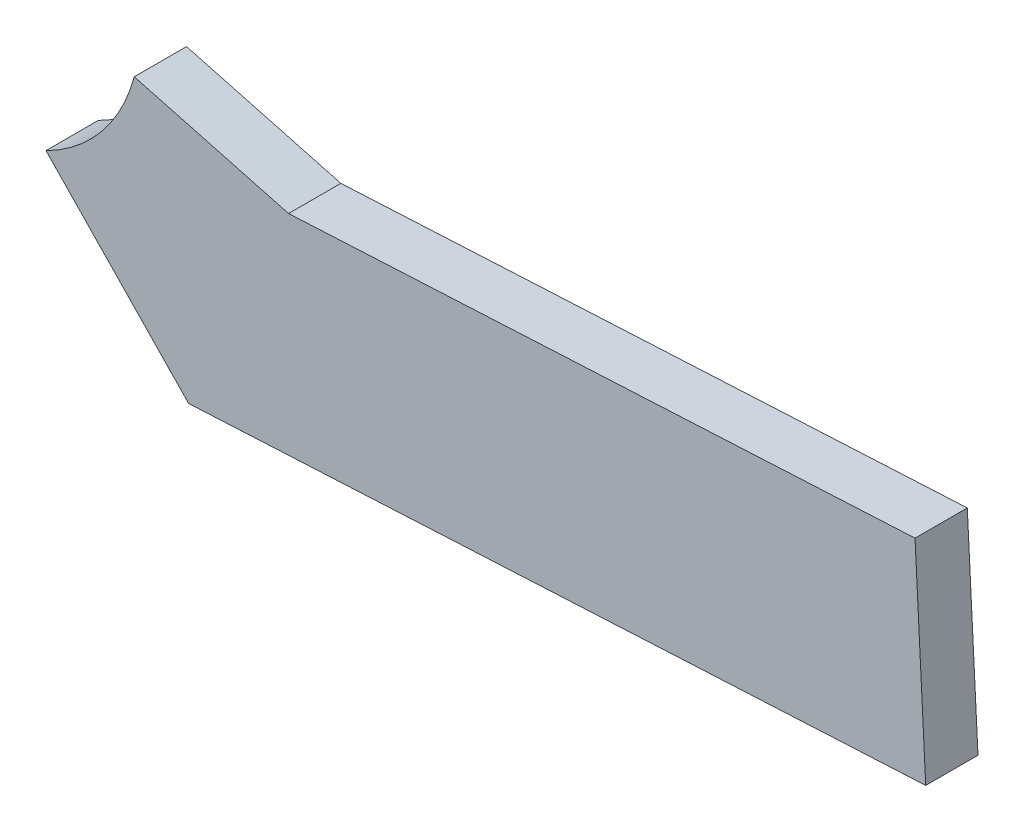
ISO-10303-21;
HEADER;
FILE_DESCRIPTION(('STEP AP214'),'2;1');
FILE_NAME('part.step','',(''),(''),'','','');
FILE_SCHEMA(('AUTOMOTIVE_DESIGN { 1 0 10303 214 1 1 1 1 }'));
ENDSEC;
DATA;
#1=APPLICATION_CONTEXT('core data for automotive mechanical design processes');
#2=APPLICATION_PROTOCOL_DEFINITION('international standard','automotive_design',2000,#1);
#3=PRODUCT_CONTEXT('',#1,'mechanical');
#4=PRODUCT('Part','Part','',(#3));
#5=PRODUCT_RELATED_PRODUCT_CATEGORY('part','',(#4));
#6=PRODUCT_DEFINITION_FORMATION('','',#4);
#7=PRODUCT_DEFINITION_CONTEXT('part definition',#1,'design');
#8=PRODUCT_DEFINITION('design','',#6,#7);
#9=PRODUCT_DEFINITION_SHAPE('','',#8);
#10=(LENGTH_UNIT() NAMED_UNIT(*) SI_UNIT(.MILLI.,.METRE.));
#11=(NAMED_UNIT(*) PLANE_ANGLE_UNIT() SI_UNIT($,.RADIAN.));
#12=(NAMED_UNIT(*) SI_UNIT($,.STERADIAN.) SOLID_ANGLE_UNIT());
#13=UNCERTAINTY_MEASURE_WITH_UNIT(LENGTH_MEASURE(1.E-05),#10,'distance_accuracy_value','');
#14=(GEOMETRIC_REPRESENTATION_CONTEXT(3) GLOBAL_UNCERTAINTY_ASSIGNED_CONTEXT((#13)) GLOBAL_UNIT_ASSIGNED_CONTEXT((#10,
#11,#12)) REPRESENTATION_CONTEXT('',''));
#15=CARTESIAN_POINT('',(0.,0.,0.));
#16=DIRECTION('',(0.,0.,1.));
#17=DIRECTION('',(1.,0.,0.));
#18=AXIS2_PLACEMENT_3D('',#15,#16,#17);
#19=CARTESIAN_POINT('',(246.482371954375,13.1523666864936,0.));
#20=DIRECTION('',(0.,0.,1.));
#21=DIRECTION('',(0.,-1.,0.));
#22=AXIS2_PLACEMENT_3D('',#19,#20,#21);
#23=CYLINDRICAL_SURFACE('',#22,20.6375);
#24=DIRECTION('',(0.,0.,1.));
#25=VECTOR('',#24,1.);
#26=CARTESIAN_POINT('',(255.695398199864,-5.31453759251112,0.));
#27=LINE('',#26,#25);
#28=CARTESIAN_POINT('',(255.695398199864,-5.31453759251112,0.));
#29=VERTEX_POINT('',#28);
#30=CARTESIAN_POINT('',(255.695398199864,-5.31453759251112,6.35));
#31=VERTEX_POINT('',#30);
#32=EDGE_CURVE('E35',#29,#31,#27,.T.);
#33=ORIENTED_EDGE('',*,*,#32,.T.);
#34=CARTESIAN_POINT('',(246.482371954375,13.1523666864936,6.35));
#35=DIRECTION('',(0.,0.,-1.));
#36=DIRECTION('',(0.,-1.,0.));
#37=AXIS2_PLACEMENT_3D('',#34,#35,#36);
#38=CIRCLE('',#37,20.6375);
#39=CARTESIAN_POINT('',(266.418071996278,7.81623793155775,6.35));
#40=VERTEX_POINT('',#39);
#41=EDGE_CURVE('E84',#40,#31,#38,.T.);
#42=ORIENTED_EDGE('',*,*,#41,.F.);
#43=DIRECTION('',(0.,0.,1.));
#44=VECTOR('',#43,1.);
#45=CARTESIAN_POINT('',(266.418071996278,7.81623793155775,0.));
#46=LINE('',#45,#44);
#47=CARTESIAN_POINT('',(266.418071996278,7.81623793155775,0.));
#48=VERTEX_POINT('',#47);
#49=EDGE_CURVE('E11',#48,#40,#46,.T.);
#50=ORIENTED_EDGE('',*,*,#49,.F.);
#51=CARTESIAN_POINT('',(246.482371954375,13.1523666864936,0.));
#52=DIRECTION('',(0.,0.,-1.));
#53=DIRECTION('',(0.,-1.,0.));
#54=AXIS2_PLACEMENT_3D('',#51,#52,#53);
#55=CIRCLE('',#54,20.6375);
#56=EDGE_CURVE('E85',#48,#29,#55,.T.);
#57=ORIENTED_EDGE('',*,*,#56,.T.);
#58=EDGE_LOOP('',(#33,#42,#50,#57));
#59=FACE_BOUND('',#58,.T.);
#60=ADVANCED_FACE('F32',(#59),#23,.F.);
#61=CARTESIAN_POINT('',(266.418071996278,7.81623793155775,0.));
#62=DIRECTION('',(0.258564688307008,0.965993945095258,0.));
#63=DIRECTION('',(-0.965993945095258,0.258564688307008,0.));
#64=AXIS2_PLACEMENT_3D('',#61,#62,#63);
#65=PLANE('',#64);
#66=ORIENTED_EDGE('',*,*,#49,.T.);
#67=DIRECTION('',(-0.965993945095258,0.258564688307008,0.));
#68=VECTOR('',#67,1.);
#69=CARTESIAN_POINT('',(266.418071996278,7.81623793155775,6.35));
#70=LINE('',#69,#68);
#71=CARTESIAN_POINT('',(285.163311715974,2.79875610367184,6.35));
#72=VERTEX_POINT('',#71);
#73=EDGE_CURVE('E102',#72,#40,#70,.T.);
#74=ORIENTED_EDGE('',*,*,#73,.F.);
#75=DIRECTION('',(0.,0.,1.));
#76=VECTOR('',#75,1.);
#77=CARTESIAN_POINT('',(285.163311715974,2.79875610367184,0.));
#78=LINE('',#77,#76);
#79=CARTESIAN_POINT('',(285.163311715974,2.79875610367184,0.));
#80=VERTEX_POINT('',#79);
#81=EDGE_CURVE('E40',#80,#72,#78,.T.);
#82=ORIENTED_EDGE('',*,*,#81,.F.);
#83=DIRECTION('',(-0.965993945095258,0.258564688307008,0.));
#84=VECTOR('',#83,1.);
#85=CARTESIAN_POINT('',(266.418071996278,7.81623793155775,0.));
#86=LINE('',#85,#84);
#87=EDGE_CURVE('E90',#80,#48,#86,.T.);
#88=ORIENTED_EDGE('',*,*,#87,.T.);
#89=EDGE_LOOP('',(#66,#74,#82,#88));
#90=FACE_BOUND('',#89,.T.);
#91=ADVANCED_FACE('F142',(#90),#65,.T.);
#92=CARTESIAN_POINT('',(285.163311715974,2.79875610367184,0.));
#93=DIRECTION('',(-0.0512082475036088,0.998687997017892,0.));
#94=DIRECTION('',(-0.998687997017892,-0.0512082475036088,0.));
#95=AXIS2_PLACEMENT_3D('',#92,#93,#94);
#96=PLANE('',#95);
#97=ORIENTED_EDGE('',*,*,#81,.T.);
#98=DIRECTION('',(-0.998687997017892,-0.0512082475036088,0.));
#99=VECTOR('',#98,1.);
#100=CARTESIAN_POINT('',(285.163311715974,2.79875610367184,6.35));
#101=LINE('',#100,#99);
#102=CARTESIAN_POINT('',(361.263337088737,6.70082456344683,6.35));
#103=VERTEX_POINT('',#102);
#104=EDGE_CURVE('E109',#103,#72,#101,.T.);
#105=ORIENTED_EDGE('',*,*,#104,.F.);
#106=DIRECTION('',(0.,0.,1.));
#107=VECTOR('',#106,1.);
#108=CARTESIAN_POINT('',(361.263337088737,6.70082456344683,0.));
#109=LINE('',#108,#107);
#110=CARTESIAN_POINT('',(361.263337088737,6.70082456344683,0.));
#111=VERTEX_POINT('',#110);
#112=EDGE_CURVE('E125',#111,#103,#109,.T.);
#113=ORIENTED_EDGE('',*,*,#112,.F.);
#114=DIRECTION('',(-0.998687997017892,-0.0512082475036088,0.));
#115=VECTOR('',#114,1.);
#116=CARTESIAN_POINT('',(285.163311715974,2.79875610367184,0.));
#117=LINE('',#116,#115);
#118=EDGE_CURVE('E121',#111,#80,#117,.T.);
#119=ORIENTED_EDGE('',*,*,#118,.T.);
#120=EDGE_LOOP('',(#97,#105,#113,#119));
#121=FACE_BOUND('',#120,.T.);
#122=ADVANCED_FACE('F138',(#121),#96,.T.);
#123=CARTESIAN_POINT('',(361.263337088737,6.70082456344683,0.));
#124=DIRECTION('',(0.998687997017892,0.0512082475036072,0.));
#125=DIRECTION('',(-0.0512082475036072,0.998687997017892,0.));
#126=AXIS2_PLACEMENT_3D('',#123,#124,#125);
#127=PLANE('',#126);
#128=ORIENTED_EDGE('',*,*,#112,.T.);
#129=DIRECTION('',(-0.0512082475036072,0.998687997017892,0.));
#130=VECTOR('',#129,1.);
#131=CARTESIAN_POINT('',(361.263337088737,6.70082456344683,6.35));
#132=LINE('',#131,#130);
#133=CARTESIAN_POINT('',(362.564026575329,-18.6658505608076,6.35));
#134=VERTEX_POINT('',#133);
#135=EDGE_CURVE('E106',#134,#103,#132,.T.);
#136=ORIENTED_EDGE('',*,*,#135,.F.);
#137=DIRECTION('',(0.,0.,1.));
#138=VECTOR('',#137,1.);
#139=CARTESIAN_POINT('',(362.564026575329,-18.6658505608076,0.));
#140=LINE('',#139,#138);
#141=CARTESIAN_POINT('',(362.564026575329,-18.6658505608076,0.));
#142=VERTEX_POINT('',#141);
#143=EDGE_CURVE('E127',#142,#134,#140,.T.);
#144=ORIENTED_EDGE('',*,*,#143,.F.);
#145=DIRECTION('',(-0.0512082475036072,0.998687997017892,0.));
#146=VECTOR('',#145,1.);
#147=CARTESIAN_POINT('',(361.263337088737,6.70082456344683,0.));
#148=LINE('',#147,#146);
#149=EDGE_CURVE('E118',#142,#111,#148,.T.);
#150=ORIENTED_EDGE('',*,*,#149,.T.);
#151=EDGE_LOOP('',(#128,#136,#144,#150));
#152=FACE_BOUND('',#151,.T.);
#153=ADVANCED_FACE('F135',(#152),#127,.T.);
#154=CARTESIAN_POINT('',(362.564026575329,-18.6658505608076,0.));
#155=DIRECTION('',(0.0512082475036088,-0.998687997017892,0.));
#156=DIRECTION('',(0.998687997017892,0.0512082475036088,0.));
#157=AXIS2_PLACEMENT_3D('',#154,#155,#156);
#158=PLANE('',#157);
#159=ORIENTED_EDGE('',*,*,#143,.T.);
#160=DIRECTION('',(0.998687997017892,0.0512082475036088,0.));
#161=VECTOR('',#160,1.);
#162=CARTESIAN_POINT('',(362.564026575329,-18.6658505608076,6.35));
#163=LINE('',#162,#161);
#164=CARTESIAN_POINT('',(273.019663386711,-23.2572844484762,6.35));
#165=VERTEX_POINT('',#164);
#166=EDGE_CURVE('E97',#165,#134,#163,.T.);
#167=ORIENTED_EDGE('',*,*,#166,.F.);
#168=DIRECTION('',(0.,0.,1.));
#169=VECTOR('',#168,1.);
#170=CARTESIAN_POINT('',(273.019663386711,-23.2572844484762,0.));
#171=LINE('',#170,#169);
#172=CARTESIAN_POINT('',(273.019663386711,-23.2572844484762,0.));
#173=VERTEX_POINT('',#172);
#174=EDGE_CURVE('E89',#173,#165,#171,.T.);
#175=ORIENTED_EDGE('',*,*,#174,.F.);
#176=DIRECTION('',(0.998687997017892,0.0512082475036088,0.));
#177=VECTOR('',#176,1.);
#178=CARTESIAN_POINT('',(362.564026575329,-18.6658505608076,0.));
#179=LINE('',#178,#177);
#180=EDGE_CURVE('E115',#173,#142,#179,.T.);
#181=ORIENTED_EDGE('',*,*,#180,.T.);
#182=EDGE_LOOP('',(#159,#167,#175,#181));
#183=FACE_BOUND('',#182,.T.);
#184=ADVANCED_FACE('F129',(#183),#158,.T.);
#185=CARTESIAN_POINT('',(273.019663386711,-23.2572844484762,0.));
#186=DIRECTION('',(-0.719396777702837,-0.694599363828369,0.));
#187=DIRECTION('',(0.694599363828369,-0.719396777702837,0.));
#188=AXIS2_PLACEMENT_3D('',#185,#186,#187);
#189=PLANE('',#188);
#190=ORIENTED_EDGE('',*,*,#174,.T.);
#191=DIRECTION('',(0.694599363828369,-0.719396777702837,0.));
#192=VECTOR('',#191,1.);
#193=CARTESIAN_POINT('',(273.019663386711,-23.2572844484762,6.35));
#194=LINE('',#193,#192);
#195=EDGE_CURVE('E92',#31,#165,#194,.T.);
#196=ORIENTED_EDGE('',*,*,#195,.F.);
#197=ORIENTED_EDGE('',*,*,#32,.F.);
#198=DIRECTION('',(0.694599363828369,-0.719396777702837,0.));
#199=VECTOR('',#198,1.);
#200=CARTESIAN_POINT('',(273.019663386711,-23.2572844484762,0.));
#201=LINE('',#200,#199);
#202=EDGE_CURVE('E113',#29,#173,#201,.T.);
#203=ORIENTED_EDGE('',*,*,#202,.T.);
#204=EDGE_LOOP('',(#190,#196,#197,#203));
#205=FACE_BOUND('',#204,.T.);
#206=ADVANCED_FACE('F93',(#205),#189,.T.);
#207=CARTESIAN_POINT('',(246.482371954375,13.1523666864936,0.));
#208=DIRECTION('',(0.,0.,1.));
#209=DIRECTION('',(0.,-1.,0.));
#210=AXIS2_PLACEMENT_3D('',#207,#208,#209);
#211=PLANE('',#210);
#212=ORIENTED_EDGE('',*,*,#56,.F.);
#213=ORIENTED_EDGE('',*,*,#87,.F.);
#214=ORIENTED_EDGE('',*,*,#118,.F.);
#215=ORIENTED_EDGE('',*,*,#149,.F.);
#216=ORIENTED_EDGE('',*,*,#180,.F.);
#217=ORIENTED_EDGE('',*,*,#202,.F.);
#218=EDGE_LOOP('',(#212,#213,#214,#215,#216,#217));
#219=FACE_BOUND('',#218,.T.);
#220=ADVANCED_FACE('F141',(#219),#211,.F.);
#221=CARTESIAN_POINT('',(246.482371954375,13.1523666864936,6.35));
#222=DIRECTION('',(0.,0.,1.));
#223=DIRECTION('',(0.,-1.,0.));
#224=AXIS2_PLACEMENT_3D('',#221,#222,#223);
#225=PLANE('',#224);
#226=ORIENTED_EDGE('',*,*,#41,.T.);
#227=ORIENTED_EDGE('',*,*,#195,.T.);
#228=ORIENTED_EDGE('',*,*,#166,.T.);
#229=ORIENTED_EDGE('',*,*,#135,.T.);
#230=ORIENTED_EDGE('',*,*,#104,.T.);
#231=ORIENTED_EDGE('',*,*,#73,.T.);
#232=EDGE_LOOP('',(#226,#227,#228,#229,#230,#231));
#233=FACE_BOUND('',#232,.T.);
#234=ADVANCED_FACE('F100',(#233),#225,.T.);
#235=CLOSED_SHELL('',(#60,#91,#122,#153,#184,#206,#220,#234));
#236=MANIFOLD_SOLID_BREP('B2',#235);
#237=ADVANCED_BREP_SHAPE_REPRESENTATION('',(#18,#236),#14);
#238=SHAPE_DEFINITION_REPRESENTATION(#9,#237);
ENDSEC;
END-ISO-10303-21;
